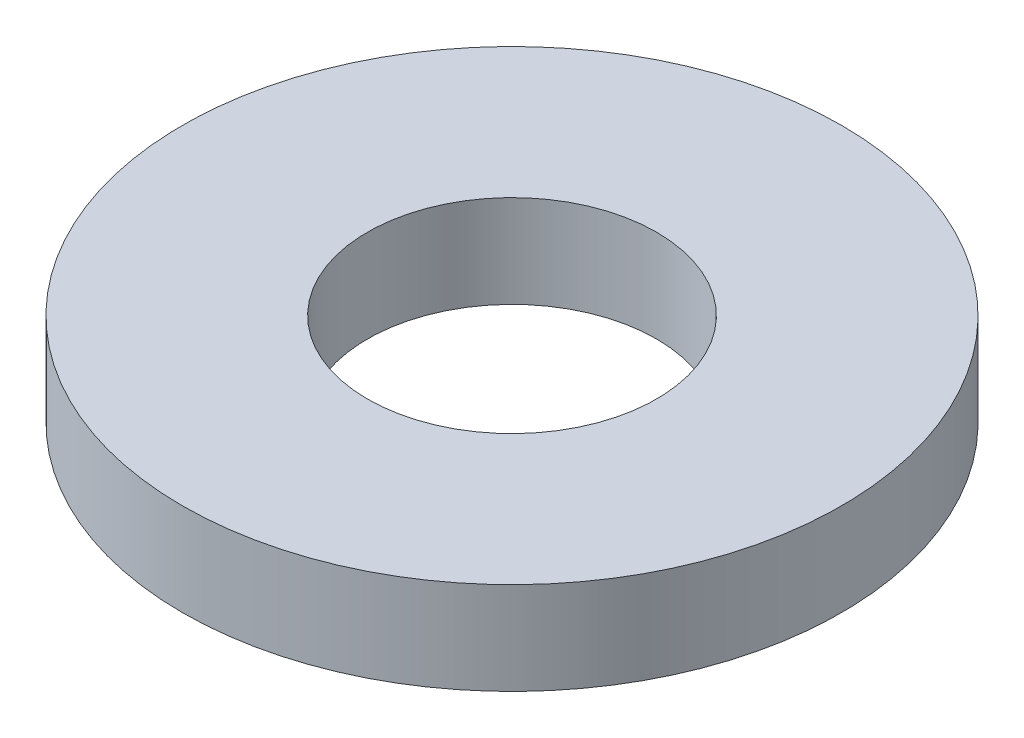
ISO-10303-21;
HEADER;
FILE_DESCRIPTION(('STEP AP214'),'2;1');
FILE_NAME('part.step','',(''),(''),'','','');
FILE_SCHEMA(('AUTOMOTIVE_DESIGN { 1 0 10303 214 1 1 1 1 }'));
ENDSEC;
DATA;
#1=APPLICATION_CONTEXT('core data for automotive mechanical design processes');
#2=APPLICATION_PROTOCOL_DEFINITION('international standard','automotive_design',2000,#1);
#3=PRODUCT_CONTEXT('',#1,'mechanical');
#4=PRODUCT('Part','Part','',(#3));
#5=PRODUCT_RELATED_PRODUCT_CATEGORY('part','',(#4));
#6=PRODUCT_DEFINITION_FORMATION('','',#4);
#7=PRODUCT_DEFINITION_CONTEXT('part definition',#1,'design');
#8=PRODUCT_DEFINITION('design','',#6,#7);
#9=PRODUCT_DEFINITION_SHAPE('','',#8);
#10=(LENGTH_UNIT() NAMED_UNIT(*) SI_UNIT(.MILLI.,.METRE.));
#11=(NAMED_UNIT(*) PLANE_ANGLE_UNIT() SI_UNIT($,.RADIAN.));
#12=(NAMED_UNIT(*) SI_UNIT($,.STERADIAN.) SOLID_ANGLE_UNIT());
#13=UNCERTAINTY_MEASURE_WITH_UNIT(LENGTH_MEASURE(1.E-05),#10,'distance_accuracy_value','');
#14=(GEOMETRIC_REPRESENTATION_CONTEXT(3) GLOBAL_UNCERTAINTY_ASSIGNED_CONTEXT((#13)) GLOBAL_UNIT_ASSIGNED_CONTEXT((#10,
#11,#12)) REPRESENTATION_CONTEXT('',''));
#15=CARTESIAN_POINT('',(0.,0.,0.));
#16=DIRECTION('',(0.,0.,1.));
#17=DIRECTION('',(1.,0.,0.));
#18=AXIS2_PLACEMENT_3D('',#15,#16,#17);
#19=CARTESIAN_POINT('',(0.,2.54,0.));
#20=DIRECTION('',(0.,1.,0.));
#21=DIRECTION('',(0.,0.,1.));
#22=AXIS2_PLACEMENT_3D('',#19,#20,#21);
#23=PLANE('',#22);
#24=CARTESIAN_POINT('',(0.,2.54,0.));
#25=DIRECTION('',(0.,1.,0.));
#26=DIRECTION('',(0.,0.,1.));
#27=AXIS2_PLACEMENT_3D('',#24,#25,#26);
#28=CIRCLE('',#27,9.04875);
#29=CARTESIAN_POINT('',(0.,2.54,9.04875));
#30=VERTEX_POINT('',#29);
#31=EDGE_CURVE('E10',#30,#30,#28,.T.);
#32=ORIENTED_EDGE('',*,*,#31,.T.);
#33=EDGE_LOOP('',(#32));
#34=FACE_BOUND('',#33,.T.);
#35=CARTESIAN_POINT('',(0.,2.54,0.));
#36=DIRECTION('',(0.,1.,0.));
#37=DIRECTION('',(0.,0.,1.));
#38=AXIS2_PLACEMENT_3D('',#35,#36,#37);
#39=CIRCLE('',#38,3.96875);
#40=CARTESIAN_POINT('',(0.,2.54,3.96875));
#41=VERTEX_POINT('',#40);
#42=EDGE_CURVE('E42',#41,#41,#39,.T.);
#43=ORIENTED_EDGE('',*,*,#42,.F.);
#44=EDGE_LOOP('',(#43));
#45=FACE_BOUND('',#44,.T.);
#46=ADVANCED_FACE('F31',(#34,#45),#23,.T.);
#47=CARTESIAN_POINT('',(0.,0.,0.));
#48=DIRECTION('',(0.,1.,0.));
#49=DIRECTION('',(0.,0.,1.));
#50=AXIS2_PLACEMENT_3D('',#47,#48,#49);
#51=PLANE('',#50);
#52=CARTESIAN_POINT('',(0.,0.,0.));
#53=DIRECTION('',(0.,1.,0.));
#54=DIRECTION('',(0.,0.,1.));
#55=AXIS2_PLACEMENT_3D('',#52,#53,#54);
#56=CIRCLE('',#55,9.04875);
#57=CARTESIAN_POINT('',(0.,0.,9.04875));
#58=VERTEX_POINT('',#57);
#59=EDGE_CURVE('E35',#58,#58,#56,.T.);
#60=ORIENTED_EDGE('',*,*,#59,.F.);
#61=EDGE_LOOP('',(#60));
#62=FACE_BOUND('',#61,.T.);
#63=CARTESIAN_POINT('',(0.,0.,0.));
#64=DIRECTION('',(0.,1.,0.));
#65=DIRECTION('',(0.,0.,1.));
#66=AXIS2_PLACEMENT_3D('',#63,#64,#65);
#67=CIRCLE('',#66,3.96875);
#68=CARTESIAN_POINT('',(0.,0.,3.96875));
#69=VERTEX_POINT('',#68);
#70=EDGE_CURVE('E44',#69,#69,#67,.T.);
#71=ORIENTED_EDGE('',*,*,#70,.T.);
#72=EDGE_LOOP('',(#71));
#73=FACE_BOUND('',#72,.T.);
#74=ADVANCED_FACE('F54',(#62,#73),#51,.F.);
#75=CARTESIAN_POINT('',(0.,2.54,0.));
#76=DIRECTION('',(0.,-1.,0.));
#77=DIRECTION('',(0.,0.,-1.));
#78=AXIS2_PLACEMENT_3D('',#75,#76,#77);
#79=CYLINDRICAL_SURFACE('',#78,9.04875);
#80=ORIENTED_EDGE('',*,*,#31,.F.);
#81=EDGE_LOOP('',(#80));
#82=FACE_BOUND('',#81,.T.);
#83=ORIENTED_EDGE('',*,*,#59,.T.);
#84=EDGE_LOOP('',(#83));
#85=FACE_BOUND('',#84,.T.);
#86=ADVANCED_FACE('F33',(#82,#85),#79,.T.);
#87=CARTESIAN_POINT('',(0.,2.54,0.));
#88=DIRECTION('',(0.,-1.,0.));
#89=DIRECTION('',(0.,0.,-1.));
#90=AXIS2_PLACEMENT_3D('',#87,#88,#89);
#91=CYLINDRICAL_SURFACE('',#90,3.96875);
#92=ORIENTED_EDGE('',*,*,#42,.T.);
#93=EDGE_LOOP('',(#92));
#94=FACE_BOUND('',#93,.T.);
#95=ORIENTED_EDGE('',*,*,#70,.F.);
#96=EDGE_LOOP('',(#95));
#97=FACE_BOUND('',#96,.T.);
#98=ADVANCED_FACE('F50',(#94,#97),#91,.F.);
#99=CLOSED_SHELL('',(#46,#74,#86,#98));
#100=MANIFOLD_SOLID_BREP('B2',#99);
#101=ADVANCED_BREP_SHAPE_REPRESENTATION('',(#18,#100),#14);
#102=SHAPE_DEFINITION_REPRESENTATION(#9,#101);
ENDSEC;
END-ISO-10303-21;
